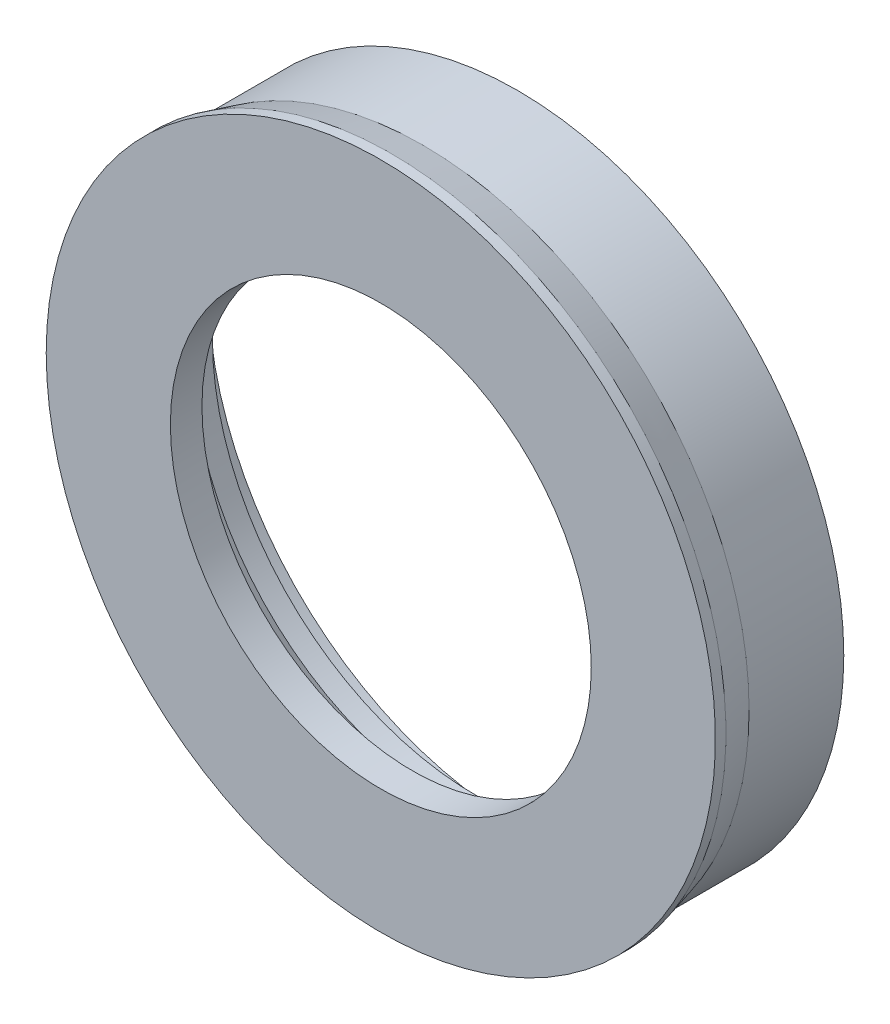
ISO-10303-21;
HEADER;
FILE_DESCRIPTION(('STEP AP214'),'2;1');
FILE_NAME('part.step','',(''),(''),'','','');
FILE_SCHEMA(('AUTOMOTIVE_DESIGN { 1 0 10303 214 1 1 1 1 }'));
ENDSEC;
DATA;
#1=APPLICATION_CONTEXT('core data for automotive mechanical design processes');
#2=APPLICATION_PROTOCOL_DEFINITION('international standard','automotive_design',2000,#1);
#3=PRODUCT_CONTEXT('',#1,'mechanical');
#4=PRODUCT('Part','Part','',(#3));
#5=PRODUCT_RELATED_PRODUCT_CATEGORY('part','',(#4));
#6=PRODUCT_DEFINITION_FORMATION('','',#4);
#7=PRODUCT_DEFINITION_CONTEXT('part definition',#1,'design');
#8=PRODUCT_DEFINITION('design','',#6,#7);
#9=PRODUCT_DEFINITION_SHAPE('','',#8);
#10=(LENGTH_UNIT() NAMED_UNIT(*) SI_UNIT(.MILLI.,.METRE.));
#11=(NAMED_UNIT(*) PLANE_ANGLE_UNIT() SI_UNIT($,.RADIAN.));
#12=(NAMED_UNIT(*) SI_UNIT($,.STERADIAN.) SOLID_ANGLE_UNIT());
#13=UNCERTAINTY_MEASURE_WITH_UNIT(LENGTH_MEASURE(1.E-05),#10,'distance_accuracy_value','');
#14=(GEOMETRIC_REPRESENTATION_CONTEXT(3) GLOBAL_UNCERTAINTY_ASSIGNED_CONTEXT((#13)) GLOBAL_UNIT_ASSIGNED_CONTEXT((#10,
#11,#12)) REPRESENTATION_CONTEXT('',''));
#15=CARTESIAN_POINT('',(0.,0.,0.));
#16=DIRECTION('',(0.,0.,1.));
#17=DIRECTION('',(1.,0.,0.));
#18=AXIS2_PLACEMENT_3D('',#15,#16,#17);
#19=CARTESIAN_POINT('',(0.,12.5,0.));
#20=DIRECTION('',(0.,0.,-1.));
#21=DIRECTION('',(-1.,0.,0.));
#22=AXIS2_PLACEMENT_3D('',#19,#20,#21);
#23=PLANE('',#22);
#24=CARTESIAN_POINT('',(0.,0.,0.));
#25=DIRECTION('',(0.,0.,-1.));
#26=DIRECTION('',(-1.,0.,0.));
#27=AXIS2_PLACEMENT_3D('',#24,#25,#26);
#28=CIRCLE('',#27,12.5);
#29=CARTESIAN_POINT('',(-12.5,0.,0.));
#30=VERTEX_POINT('',#29);
#31=EDGE_CURVE('E71',#30,#30,#28,.T.);
#32=ORIENTED_EDGE('',*,*,#31,.T.);
#33=EDGE_LOOP('',(#32));
#34=FACE_BOUND('',#33,.T.);
#35=CARTESIAN_POINT('',(0.,0.,0.));
#36=DIRECTION('',(0.,0.,-1.));
#37=DIRECTION('',(-1.,0.,0.));
#38=AXIS2_PLACEMENT_3D('',#35,#36,#37);
#39=CIRCLE('',#38,10.);
#40=CARTESIAN_POINT('',(-10.,0.,0.));
#41=VERTEX_POINT('',#40);
#42=EDGE_CURVE('E10',#41,#41,#39,.T.);
#43=ORIENTED_EDGE('',*,*,#42,.F.);
#44=EDGE_LOOP('',(#43));
#45=FACE_BOUND('',#44,.T.);
#46=ADVANCED_FACE('F28',(#34,#45),#23,.T.);
#47=CARTESIAN_POINT('',(0.,0.,0.));
#48=DIRECTION('',(0.,0.,-1.));
#49=DIRECTION('',(-1.,0.,0.));
#50=AXIS2_PLACEMENT_3D('',#47,#48,#49);
#51=CYLINDRICAL_SURFACE('',#50,10.);
#52=ORIENTED_EDGE('',*,*,#42,.T.);
#53=EDGE_LOOP('',(#52));
#54=FACE_BOUND('',#53,.T.);
#55=CARTESIAN_POINT('',(0.,0.,1.5));
#56=DIRECTION('',(0.,0.,-1.));
#57=DIRECTION('',(-1.,0.,0.));
#58=AXIS2_PLACEMENT_3D('',#55,#56,#57);
#59=CIRCLE('',#58,10.);
#60=CARTESIAN_POINT('',(-10.,0.,1.5));
#61=VERTEX_POINT('',#60);
#62=EDGE_CURVE('E34',#61,#61,#59,.T.);
#63=ORIENTED_EDGE('',*,*,#62,.F.);
#64=EDGE_LOOP('',(#63));
#65=FACE_BOUND('',#64,.T.);
#66=ADVANCED_FACE('F89',(#54,#65),#51,.F.);
#67=CARTESIAN_POINT('',(0.,10.,1.5));
#68=DIRECTION('',(0.,0.,1.));
#69=DIRECTION('',(1.,0.,0.));
#70=AXIS2_PLACEMENT_3D('',#67,#68,#69);
#71=PLANE('',#70);
#72=ORIENTED_EDGE('',*,*,#62,.T.);
#73=EDGE_LOOP('',(#72));
#74=FACE_BOUND('',#73,.T.);
#75=CARTESIAN_POINT('',(0.,0.,1.5));
#76=DIRECTION('',(0.,0.,-1.));
#77=DIRECTION('',(-1.,0.,0.));
#78=AXIS2_PLACEMENT_3D('',#75,#76,#77);
#79=CIRCLE('',#78,15.9);
#80=CARTESIAN_POINT('',(-15.9,0.,1.5));
#81=VERTEX_POINT('',#80);
#82=EDGE_CURVE('E38',#81,#81,#79,.T.);
#83=ORIENTED_EDGE('',*,*,#82,.F.);
#84=EDGE_LOOP('',(#83));
#85=FACE_BOUND('',#84,.T.);
#86=ADVANCED_FACE('F93',(#74,#85),#71,.T.);
#87=CARTESIAN_POINT('',(0.,0.,0.));
#88=DIRECTION('',(0.,0.,-1.));
#89=DIRECTION('',(-1.,0.,0.));
#90=AXIS2_PLACEMENT_3D('',#87,#88,#89);
#91=CYLINDRICAL_SURFACE('',#90,15.9);
#92=ORIENTED_EDGE('',*,*,#82,.T.);
#93=EDGE_LOOP('',(#92));
#94=FACE_BOUND('',#93,.T.);
#95=CARTESIAN_POINT('',(0.,0.,1.));
#96=DIRECTION('',(0.,0.,-1.));
#97=DIRECTION('',(-1.,0.,0.));
#98=AXIS2_PLACEMENT_3D('',#95,#96,#97);
#99=CIRCLE('',#98,15.9);
#100=CARTESIAN_POINT('',(-15.9,0.,1.));
#101=VERTEX_POINT('',#100);
#102=EDGE_CURVE('E42',#101,#101,#99,.T.);
#103=ORIENTED_EDGE('',*,*,#102,.F.);
#104=EDGE_LOOP('',(#103));
#105=FACE_BOUND('',#104,.T.);
#106=ADVANCED_FACE('F97',(#94,#105),#91,.T.);
#107=CARTESIAN_POINT('',(0.,0.,-0.5));
#108=DIRECTION('',(0.,0.,1.));
#109=DIRECTION('',(1.,0.,0.));
#110=AXIS2_PLACEMENT_3D('',#107,#108,#109);
#111=CONICAL_SURFACE('',#110,15.5,0.260602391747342);
#112=ORIENTED_EDGE('',*,*,#102,.T.);
#113=EDGE_LOOP('',(#112));
#114=FACE_BOUND('',#113,.T.);
#115=CARTESIAN_POINT('',(0.,0.,-0.5));
#116=DIRECTION('',(0.,0.,-1.));
#117=DIRECTION('',(-1.,0.,0.));
#118=AXIS2_PLACEMENT_3D('',#115,#116,#117);
#119=CIRCLE('',#118,15.5);
#120=CARTESIAN_POINT('',(-15.5,0.,-0.5));
#121=VERTEX_POINT('',#120);
#122=EDGE_CURVE('E47',#121,#121,#119,.T.);
#123=ORIENTED_EDGE('',*,*,#122,.F.);
#124=EDGE_LOOP('',(#123));
#125=FACE_BOUND('',#124,.T.);
#126=ADVANCED_FACE('F103',(#114,#125),#111,.T.);
#127=CARTESIAN_POINT('',(0.,0.,0.));
#128=DIRECTION('',(0.,0.,-1.));
#129=DIRECTION('',(-1.,0.,0.));
#130=AXIS2_PLACEMENT_3D('',#127,#128,#129);
#131=CYLINDRICAL_SURFACE('',#130,15.5);
#132=ORIENTED_EDGE('',*,*,#122,.T.);
#133=EDGE_LOOP('',(#132));
#134=FACE_BOUND('',#133,.T.);
#135=CARTESIAN_POINT('',(0.,0.,-5.));
#136=DIRECTION('',(0.,0.,-1.));
#137=DIRECTION('',(-1.,0.,0.));
#138=AXIS2_PLACEMENT_3D('',#135,#136,#137);
#139=CIRCLE('',#138,15.5);
#140=CARTESIAN_POINT('',(-15.5,0.,-5.));
#141=VERTEX_POINT('',#140);
#142=EDGE_CURVE('E50',#141,#141,#139,.T.);
#143=ORIENTED_EDGE('',*,*,#142,.F.);
#144=EDGE_LOOP('',(#143));
#145=FACE_BOUND('',#144,.T.);
#146=ADVANCED_FACE('F107',(#134,#145),#131,.T.);
#147=CARTESIAN_POINT('',(0.,15.5,-5.));
#148=DIRECTION('',(0.,0.,-1.));
#149=DIRECTION('',(-1.,0.,0.));
#150=AXIS2_PLACEMENT_3D('',#147,#148,#149);
#151=PLANE('',#150);
#152=ORIENTED_EDGE('',*,*,#142,.T.);
#153=EDGE_LOOP('',(#152));
#154=FACE_BOUND('',#153,.T.);
#155=CARTESIAN_POINT('',(0.,0.,-5.));
#156=DIRECTION('',(0.,0.,-1.));
#157=DIRECTION('',(-1.,0.,0.));
#158=AXIS2_PLACEMENT_3D('',#155,#156,#157);
#159=CIRCLE('',#158,14.7);
#160=CARTESIAN_POINT('',(-14.7,0.,-5.));
#161=VERTEX_POINT('',#160);
#162=EDGE_CURVE('E53',#161,#161,#159,.T.);
#163=ORIENTED_EDGE('',*,*,#162,.F.);
#164=EDGE_LOOP('',(#163));
#165=FACE_BOUND('',#164,.T.);
#166=ADVANCED_FACE('F111',(#154,#165),#151,.T.);
#167=CARTESIAN_POINT('',(0.,0.,0.));
#168=DIRECTION('',(0.,0.,-1.));
#169=DIRECTION('',(-1.,0.,0.));
#170=AXIS2_PLACEMENT_3D('',#167,#168,#169);
#171=CYLINDRICAL_SURFACE('',#170,14.7);
#172=ORIENTED_EDGE('',*,*,#162,.T.);
#173=EDGE_LOOP('',(#172));
#174=FACE_BOUND('',#173,.T.);
#175=CARTESIAN_POINT('',(0.,0.,-3.));
#176=DIRECTION('',(0.,0.,-1.));
#177=DIRECTION('',(-1.,0.,0.));
#178=AXIS2_PLACEMENT_3D('',#175,#176,#177);
#179=CIRCLE('',#178,14.7);
#180=CARTESIAN_POINT('',(-14.7,0.,-3.));
#181=VERTEX_POINT('',#180);
#182=EDGE_CURVE('E56',#181,#181,#179,.T.);
#183=ORIENTED_EDGE('',*,*,#182,.F.);
#184=EDGE_LOOP('',(#183));
#185=FACE_BOUND('',#184,.T.);
#186=ADVANCED_FACE('F115',(#174,#185),#171,.F.);
#187=CARTESIAN_POINT('',(0.,14.7,-3.));
#188=DIRECTION('',(0.,0.,-1.));
#189=DIRECTION('',(-1.,0.,0.));
#190=AXIS2_PLACEMENT_3D('',#187,#188,#189);
#191=PLANE('',#190);
#192=ORIENTED_EDGE('',*,*,#182,.T.);
#193=EDGE_LOOP('',(#192));
#194=FACE_BOUND('',#193,.T.);
#195=CARTESIAN_POINT('',(0.,0.,-3.));
#196=DIRECTION('',(0.,0.,-1.));
#197=DIRECTION('',(-1.,0.,0.));
#198=AXIS2_PLACEMENT_3D('',#195,#196,#197);
#199=CIRCLE('',#198,12.5);
#200=CARTESIAN_POINT('',(-12.5,0.,-3.));
#201=VERTEX_POINT('',#200);
#202=EDGE_CURVE('E59',#201,#201,#199,.T.);
#203=ORIENTED_EDGE('',*,*,#202,.F.);
#204=EDGE_LOOP('',(#203));
#205=FACE_BOUND('',#204,.T.);
#206=ADVANCED_FACE('F119',(#194,#205),#191,.T.);
#207=CARTESIAN_POINT('',(0.,0.,0.));
#208=DIRECTION('',(0.,0.,-1.));
#209=DIRECTION('',(-1.,0.,0.));
#210=AXIS2_PLACEMENT_3D('',#207,#208,#209);
#211=CYLINDRICAL_SURFACE('',#210,12.5);
#212=ORIENTED_EDGE('',*,*,#202,.T.);
#213=EDGE_LOOP('',(#212));
#214=FACE_BOUND('',#213,.T.);
#215=CARTESIAN_POINT('',(0.,0.,-2.));
#216=DIRECTION('',(0.,0.,-1.));
#217=DIRECTION('',(-1.,0.,0.));
#218=AXIS2_PLACEMENT_3D('',#215,#216,#217);
#219=CIRCLE('',#218,12.5);
#220=CARTESIAN_POINT('',(-12.5,0.,-2.));
#221=VERTEX_POINT('',#220);
#222=EDGE_CURVE('E62',#221,#221,#219,.T.);
#223=ORIENTED_EDGE('',*,*,#222,.F.);
#224=EDGE_LOOP('',(#223));
#225=FACE_BOUND('',#224,.T.);
#226=ADVANCED_FACE('F123',(#214,#225),#211,.F.);
#227=CARTESIAN_POINT('',(0.,0.,-1.));
#228=DIRECTION('',(0.,0.,-1.));
#229=DIRECTION('',(-1.,0.,0.));
#230=AXIS2_PLACEMENT_3D('',#227,#228,#229);
#231=CONICAL_SURFACE('',#230,12.,0.463647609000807);
#232=ORIENTED_EDGE('',*,*,#222,.T.);
#233=EDGE_LOOP('',(#232));
#234=FACE_BOUND('',#233,.T.);
#235=CARTESIAN_POINT('',(0.,0.,-1.));
#236=DIRECTION('',(0.,0.,-1.));
#237=DIRECTION('',(-1.,0.,0.));
#238=AXIS2_PLACEMENT_3D('',#235,#236,#237);
#239=CIRCLE('',#238,12.);
#240=CARTESIAN_POINT('',(-12.,0.,-1.));
#241=VERTEX_POINT('',#240);
#242=EDGE_CURVE('E65',#241,#241,#239,.T.);
#243=ORIENTED_EDGE('',*,*,#242,.F.);
#244=EDGE_LOOP('',(#243));
#245=FACE_BOUND('',#244,.T.);
#246=ADVANCED_FACE('F85',(#234,#245),#231,.F.);
#247=CARTESIAN_POINT('',(0.,12.5,-1.));
#248=DIRECTION('',(0.,0.,1.));
#249=DIRECTION('',(1.,0.,0.));
#250=AXIS2_PLACEMENT_3D('',#247,#248,#249);
#251=PLANE('',#250);
#252=ORIENTED_EDGE('',*,*,#242,.T.);
#253=EDGE_LOOP('',(#252));
#254=FACE_BOUND('',#253,.T.);
#255=CARTESIAN_POINT('',(0.,0.,-1.));
#256=DIRECTION('',(0.,0.,-1.));
#257=DIRECTION('',(-1.,0.,0.));
#258=AXIS2_PLACEMENT_3D('',#255,#256,#257);
#259=CIRCLE('',#258,12.5);
#260=CARTESIAN_POINT('',(-12.5,0.,-1.));
#261=VERTEX_POINT('',#260);
#262=EDGE_CURVE('E68',#261,#261,#259,.T.);
#263=ORIENTED_EDGE('',*,*,#262,.F.);
#264=EDGE_LOOP('',(#263));
#265=FACE_BOUND('',#264,.T.);
#266=ADVANCED_FACE('F79',(#254,#265),#251,.T.);
#267=CARTESIAN_POINT('',(0.,0.,0.));
#268=DIRECTION('',(0.,0.,-1.));
#269=DIRECTION('',(-1.,0.,0.));
#270=AXIS2_PLACEMENT_3D('',#267,#268,#269);
#271=CYLINDRICAL_SURFACE('',#270,12.5);
#272=ORIENTED_EDGE('',*,*,#262,.T.);
#273=EDGE_LOOP('',(#272));
#274=FACE_BOUND('',#273,.T.);
#275=ORIENTED_EDGE('',*,*,#31,.F.);
#276=EDGE_LOOP('',(#275));
#277=FACE_BOUND('',#276,.T.);
#278=ADVANCED_FACE('F77',(#274,#277),#271,.F.);
#279=CLOSED_SHELL('',(#46,#66,#86,#106,#126,#146,#166,#186,#206,#226,#246,#266,#278));
#280=MANIFOLD_SOLID_BREP('B2',#279);
#281=ADVANCED_BREP_SHAPE_REPRESENTATION('',(#18,#280),#14);
#282=SHAPE_DEFINITION_REPRESENTATION(#9,#281);
ENDSEC;
END-ISO-10303-21;
